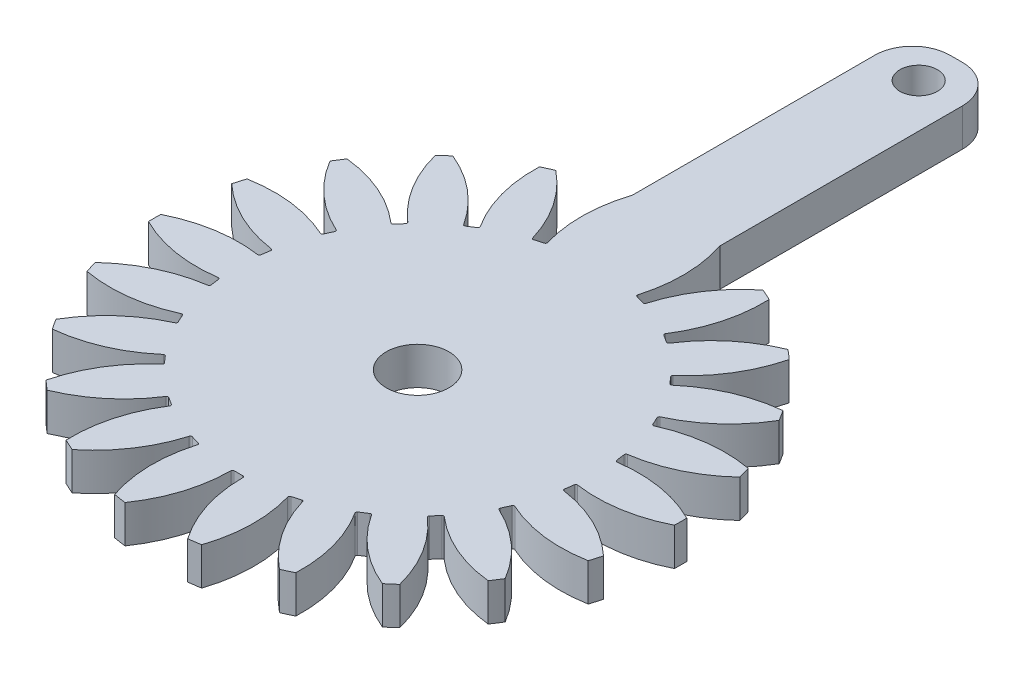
from build123d import *

# Parameters (mm, degrees)
SKETCH1_R               = 21
BOSS_EXTRUDE1_DEPTH     = 3
CUT_EXTRUDE1_DEPTH      = 30.849623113
CUT_EXTRUDE1_DEPTH_BACK = 30.849623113
SKETCH2_R               = 2.5
CUT_EXTRUDE2_DEPTH      = 30.849623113
CIRPATTERN1_COUNT       = 22
SKETCH4_W               = 7
SKETCH4_H               = 30.5
BOSS_EXTRUDE2_DEPTH     = 3
FILLET1_R               = 3
CUT_EXTRUDE3_DEPTH      = 48.947888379
CUT_EXTRUDE3_DEPTH_BACK = 48.947888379
SKETCH5_R               = 1.5


with BuildPart() as part:
    # Sketch1 → Boss-Extrude1 (new body)
    with BuildSketch(Plane(origin=(0, 0, 0), x_dir=(1, 0, 0), z_dir=(0, 1, 0))):
        with Locations(Location((0, 0, 0), (0, 0, 270))):
            Circle(SKETCH1_R)
    extrude(amount=BOSS_EXTRUDE1_DEPTH)

    # Sketch2 → Cut-Extrude1 (cut, two sides: drawn at the far end of the back side and taken through both)
    with BuildSketch(Plane(origin=(0, 3, 0), x_dir=(1, 0, 0), z_dir=(0, 1, 0)).offset(-CUT_EXTRUDE1_DEPTH_BACK)):
        with Locations(Location((0, 0, 0), (0, 0, 270))):
            Circle(SKETCH2_R)
    extrude(amount=CUT_EXTRUDE1_DEPTH + CUT_EXTRUDE1_DEPTH_BACK, mode=Mode.SUBTRACT)

    # Sketch3 → Cut-Extrude2 (cut, symmetric)
    with BuildSketch(Plane(origin=(0, 3, 0), x_dir=(1, 0, 0), z_dir=(0, 1, 0))):
        with BuildLine():
            Line((0.35, 14.3), (-0.35, 14.3))
            ThreePointArc((-0.35, 14.3), (-0.439436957, 14.337046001), (-0.476482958, 14.426482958))
            ThreePointArc((-0.476482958, 14.426482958), (-0.994323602, 17.794147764), (-2.5, 20.850659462))
            ThreePointArc((-2.5, 20.850659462), (0, 21), (2.5, 20.850659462))
            ThreePointArc((2.5, 20.850659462), (0.994323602, 17.794147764), (0.476482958, 14.426482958))
            ThreePointArc((0.476482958, 14.426482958), (0.439436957, 14.337046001), (0.35, 14.3))
        make_face()
    cut_extrude2 = extrude(amount=CUT_EXTRUDE2_DEPTH, both=True, mode=Mode.SUBTRACT)

    # CirPattern1: Cut-Extrude2 ×22 about axis
    cirpattern1_axis = Axis((0, 0, 0), (0, 1, 0))
    for i in range(1, CIRPATTERN1_COUNT):
        add(cut_extrude2.rotate(cirpattern1_axis, i * 360 / CIRPATTERN1_COUNT), mode=Mode.SUBTRACT)

    # Sketch4 → Boss-Extrude2 (add)
    with BuildSketch(Plane(origin=(0, 3, 0), x_dir=(1, 0, 0), z_dir=(0, 1, 0))):
        with Locations((0, 27.75)):
            Rectangle(SKETCH4_W, SKETCH4_H)
    extrude(amount=-BOSS_EXTRUDE2_DEPTH)

    # Fillet1
    fillet1_edges = [part.edges().sort_by_distance(p)[0] for p in [
        (3.5, 1.5, -43),
        (-3.5, 1.5, -43),
    ]]
    fillet(fillet1_edges, radius=FILLET1_R)

    # Sketch5 → Cut-Extrude3 (cut, two sides: drawn at the far end of the back side and taken through both)
    with BuildSketch(Plane(origin=(0, 3, 0), x_dir=(1, 0, 0), z_dir=(0, 1, 0)).offset(-CUT_EXTRUDE3_DEPTH_BACK)):
        with Locations(Location((0, 40, 0), (0, 0, 270))):
            Circle(SKETCH5_R)
    extrude(amount=CUT_EXTRUDE3_DEPTH + CUT_EXTRUDE3_DEPTH_BACK, mode=Mode.SUBTRACT)


solid = part.part
